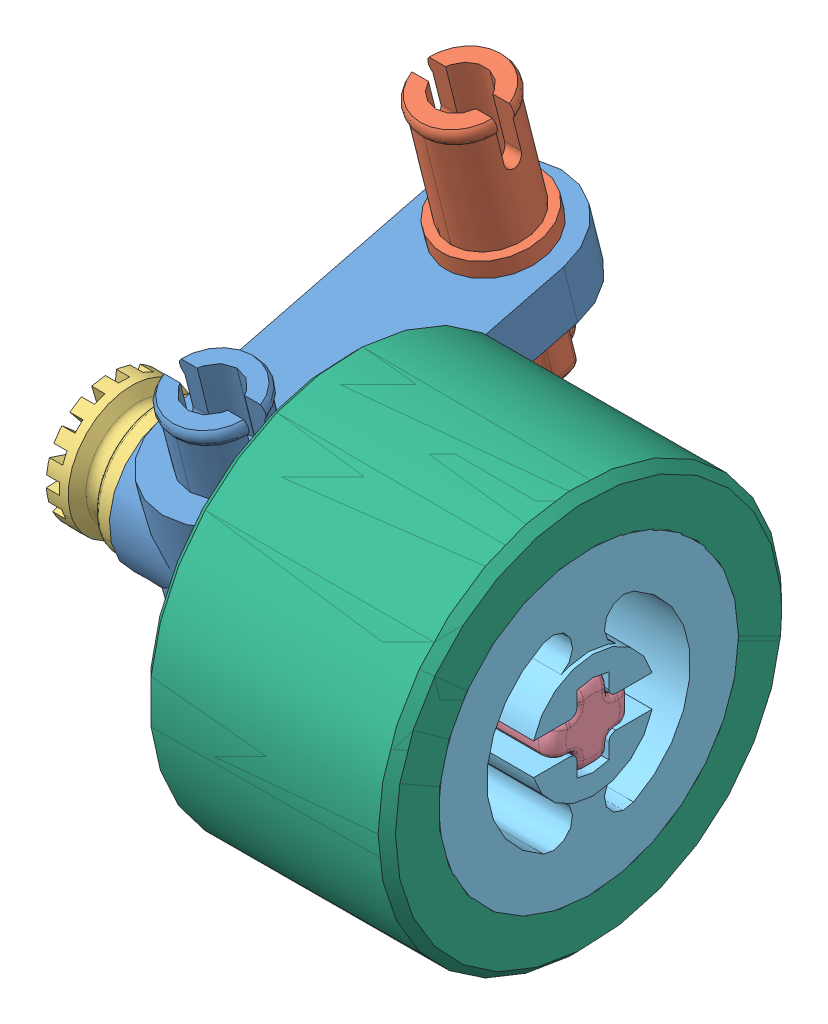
SolidWorks assembly left wheel mount.SLDASM, configuration Default (file format 4400). Lengths in mm.
Overall size (28.09 28.13 33.28).
8 component instances, 6 part files, 10 mates.
Components (placement in the parent):
- knuckle-1: knuckle.SLDPRT [Default] at (-18.0608 -11.7357 -1.707) x (0 -0.243809 0.969823) z (-1 0 0) size (23.81 17.65 7.94)
- axle pin-2: axle pin.SLDPRT [Default] at (-18.0608 -8.1993 -9.0025) x (0 -0.969823 -0.243809) z (0 -0.243809 0.969823) size (16.18 5.84 5.84)
- small collar-2: small collar.SLDPRT [Default] at (-25.9665 -15.9187 5.4259) x (0 -0.365578 0.930781) z (0 0.930781 0.365578) size (7.37 3.94 7.37)
- 4 axle-4: 4 axle.SLDPRT [Default] at (-11.9683 -15.9187 5.4259) size (28.09 4.72 4.72)
- Assem1brede wielen-2: Assem1brede wielen.SLDASM [Default] at (-1.7003 -18.261 5.0985) size (14.73 23.39 23.39)
  - wheelDubbel reed-1: wheelDubbel reed.sldprt [Default] at (-3.6359 2.3422 0.3273) size (14.73 17.39 17.39)
  - tireSlik-3: tireSlik.sldprt [Default] at (65.1518 2.3422 0.3273) size (14.22 23.39 23.39)
  - tireSlik-4: tireSlik.sldprt [Default] at (65.1518 2.3422 0.3273) size (14.22 23.39 23.39)
Mates (geometry in assembly coordinates):
- Concentric7: concentric aligned: cylinder of knuckle-1 through (-18.0608 -11.4016 -9.8075) axis (0 0.969823 0.243809) radius 2.3876; cylinder of axle pin-2 through (-18.0608 -15.8356 -10.9222) axis (0 0.969823 0.243809) radius 2.3622
- Parallel5: parallel anti-aligned: plane of knuckle-1 through (-18.9815 -11.1771 -10.7005) normal (1 0 0); plane of axle pin-2 through (-18.9815 -7.6689 -11.1122) normal (-1 0 0)
- Coincident10: coincident anti-aligned: plane of knuckle-1 through (-18.0608 -12.0697 6.3935) normal (0 0.969823 0.243809); plane of axle pin-2 through (-18.0608 -8.1993 -9.0025) normal (0 -0.969823 -0.243809)
- Concentric13: concentric anti-aligned: circle of knuckle-1; circle of 4 axle-4
- Concentric14: concentric anti-aligned: circle of small collar-2; circle of 4 axle-4
- Coincident14: coincident anti-aligned: plane of knuckle-1 through (-22.0295 -12.0697 6.3935) normal (-1 0 0); plane of small collar-2 through (-22.0295 -15.9187 5.4259) normal (1 0 0)
- Coincident15: coincident aligned: plane of small collar-2 through (-25.9665 -15.9187 5.4259) normal (-1 0 0); plane of 4 axle-4 through (-25.9665 -15.9187 5.4259) normal (-1 0 0)
- Coincident16: coincident anti-aligned: plane of 4 axle-4 through (-25.9665 -14.998 4.5051) normal (0 1 0); plane of Assem1brede wielen-2/wheelDubbel reed-1 through (-5.3362 -14.998 1.9911) normal (0 -1 0)
- Coincident17: coincident anti-aligned: plane of 4 axle-4 through (-26.0129 -14.998 6.3466) normal (0 0 1); plane of Assem1brede wielen-2/wheelDubbel reed-1 through (-5.3362 -14.998 6.3466) normal (0 0 -1)
- Coincident19: coincident aligned: plane of 4 axle-4 through (2.0298 -15.9187 5.4259) normal (1 0 0); plane of Assem1brede wielen-2/wheelDubbel reed-1 through (2.0298 -15.9187 5.4259) normal (1 0 0)
